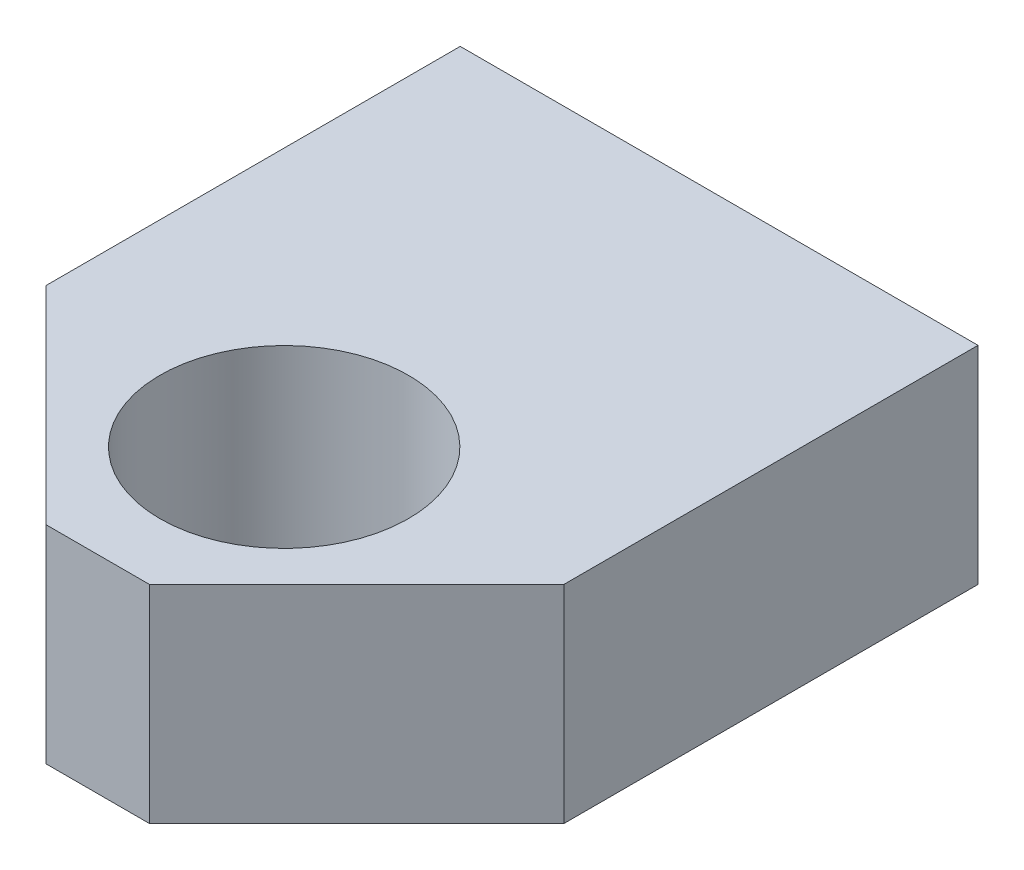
ISO-10303-21;
HEADER;
FILE_DESCRIPTION(('STEP AP214'),'2;1');
FILE_NAME('part.step','',(''),(''),'','','');
FILE_SCHEMA(('AUTOMOTIVE_DESIGN { 1 0 10303 214 1 1 1 1 }'));
ENDSEC;
DATA;
#1=APPLICATION_CONTEXT('core data for automotive mechanical design processes');
#2=APPLICATION_PROTOCOL_DEFINITION('international standard','automotive_design',2000,#1);
#3=PRODUCT_CONTEXT('',#1,'mechanical');
#4=PRODUCT('Part','Part','',(#3));
#5=PRODUCT_RELATED_PRODUCT_CATEGORY('part','',(#4));
#6=PRODUCT_DEFINITION_FORMATION('','',#4);
#7=PRODUCT_DEFINITION_CONTEXT('part definition',#1,'design');
#8=PRODUCT_DEFINITION('design','',#6,#7);
#9=PRODUCT_DEFINITION_SHAPE('','',#8);
#10=(LENGTH_UNIT() NAMED_UNIT(*) SI_UNIT(.MILLI.,.METRE.));
#11=(NAMED_UNIT(*) PLANE_ANGLE_UNIT() SI_UNIT($,.RADIAN.));
#12=(NAMED_UNIT(*) SI_UNIT($,.STERADIAN.) SOLID_ANGLE_UNIT());
#13=UNCERTAINTY_MEASURE_WITH_UNIT(LENGTH_MEASURE(1.E-05),#10,'distance_accuracy_value','');
#14=(GEOMETRIC_REPRESENTATION_CONTEXT(3) GLOBAL_UNCERTAINTY_ASSIGNED_CONTEXT((#13)) GLOBAL_UNIT_ASSIGNED_CONTEXT((#10,
#11,#12)) REPRESENTATION_CONTEXT('',''));
#15=CARTESIAN_POINT('',(0.,0.,0.));
#16=DIRECTION('',(0.,0.,1.));
#17=DIRECTION('',(1.,0.,0.));
#18=AXIS2_PLACEMENT_3D('',#15,#16,#17);
#19=CARTESIAN_POINT('',(-12.5,0.,30.));
#20=DIRECTION('',(1.,0.,0.));
#21=DIRECTION('',(0.,0.,-1.));
#22=AXIS2_PLACEMENT_3D('',#19,#20,#21);
#23=PLANE('',#22);
#24=DIRECTION('',(0.,0.,-1.));
#25=VECTOR('',#24,1.);
#26=CARTESIAN_POINT('',(-12.5,-10.,30.));
#27=LINE('',#26,#25);
#28=CARTESIAN_POINT('',(-12.5,-10.,20.));
#29=VERTEX_POINT('',#28);
#30=CARTESIAN_POINT('',(-12.5,-10.,0.));
#31=VERTEX_POINT('',#30);
#32=EDGE_CURVE('E85',#29,#31,#27,.T.);
#33=ORIENTED_EDGE('',*,*,#32,.F.);
#34=DIRECTION('',(0.,1.,0.));
#35=VECTOR('',#34,1.);
#36=CARTESIAN_POINT('',(-12.5,0.,20.));
#37=LINE('',#36,#35);
#38=CARTESIAN_POINT('',(-12.5,0.,20.));
#39=VERTEX_POINT('',#38);
#40=EDGE_CURVE('E56',#29,#39,#37,.T.);
#41=ORIENTED_EDGE('',*,*,#40,.T.);
#42=DIRECTION('',(0.,0.,-1.));
#43=VECTOR('',#42,1.);
#44=CARTESIAN_POINT('',(-12.5,0.,30.));
#45=LINE('',#44,#43);
#46=CARTESIAN_POINT('',(-12.5,0.,0.));
#47=VERTEX_POINT('',#46);
#48=EDGE_CURVE('E105',#39,#47,#45,.T.);
#49=ORIENTED_EDGE('',*,*,#48,.T.);
#50=DIRECTION('',(0.,-1.,0.));
#51=VECTOR('',#50,1.);
#52=CARTESIAN_POINT('',(-12.5,0.,0.));
#53=LINE('',#52,#51);
#54=EDGE_CURVE('E101',#47,#31,#53,.T.);
#55=ORIENTED_EDGE('',*,*,#54,.T.);
#56=EDGE_LOOP('',(#33,#41,#49,#55));
#57=FACE_BOUND('',#56,.T.);
#58=ADVANCED_FACE('F33',(#57),#23,.F.);
#59=CARTESIAN_POINT('',(-12.5,-10.,30.));
#60=DIRECTION('',(0.,1.,0.));
#61=DIRECTION('',(0.,0.,1.));
#62=AXIS2_PLACEMENT_3D('',#59,#60,#61);
#63=PLANE('',#62);
#64=CARTESIAN_POINT('',(0.,-10.,21.));
#65=DIRECTION('',(0.,1.,0.));
#66=DIRECTION('',(0.,0.,1.));
#67=AXIS2_PLACEMENT_3D('',#64,#65,#66);
#68=CIRCLE('',#67,6.);
#69=CARTESIAN_POINT('',(0.,-10.,27.));
#70=VERTEX_POINT('',#69);
#71=EDGE_CURVE('E107',#70,#70,#68,.T.);
#72=ORIENTED_EDGE('',*,*,#71,.T.);
#73=EDGE_LOOP('',(#72));
#74=FACE_BOUND('',#73,.T.);
#75=DIRECTION('',(1.,0.,0.));
#76=VECTOR('',#75,1.);
#77=CARTESIAN_POINT('',(-12.5,-10.,30.));
#78=LINE('',#77,#76);
#79=CARTESIAN_POINT('',(-2.5,-10.,30.));
#80=VERTEX_POINT('',#79);
#81=CARTESIAN_POINT('',(2.49999999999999,-10.,30.));
#82=VERTEX_POINT('',#81);
#83=EDGE_CURVE('E119',#80,#82,#78,.T.);
#84=ORIENTED_EDGE('',*,*,#83,.F.);
#85=DIRECTION('',(-0.707106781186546,0.,-0.707106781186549));
#86=VECTOR('',#85,1.);
#87=CARTESIAN_POINT('',(-2.5,-10.,30.));
#88=LINE('',#87,#86);
#89=EDGE_CURVE('E92',#80,#29,#88,.T.);
#90=ORIENTED_EDGE('',*,*,#89,.T.);
#91=ORIENTED_EDGE('',*,*,#32,.T.);
#92=DIRECTION('',(1.,0.,0.));
#93=VECTOR('',#92,1.);
#94=CARTESIAN_POINT('',(-12.5,-10.,0.));
#95=LINE('',#94,#93);
#96=CARTESIAN_POINT('',(12.5,-10.,0.));
#97=VERTEX_POINT('',#96);
#98=EDGE_CURVE('E90',#31,#97,#95,.T.);
#99=ORIENTED_EDGE('',*,*,#98,.T.);
#100=DIRECTION('',(0.,0.,-1.));
#101=VECTOR('',#100,1.);
#102=CARTESIAN_POINT('',(12.5,-10.,30.));
#103=LINE('',#102,#101);
#104=CARTESIAN_POINT('',(12.5,-10.,20.));
#105=VERTEX_POINT('',#104);
#106=EDGE_CURVE('E95',#105,#97,#103,.T.);
#107=ORIENTED_EDGE('',*,*,#106,.F.);
#108=DIRECTION('',(-0.707106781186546,0.,0.707106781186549));
#109=VECTOR('',#108,1.);
#110=CARTESIAN_POINT('',(2.5,-10.,30.));
#111=LINE('',#110,#109);
#112=EDGE_CURVE('E129',#105,#82,#111,.T.);
#113=ORIENTED_EDGE('',*,*,#112,.T.);
#114=EDGE_LOOP('',(#84,#90,#91,#99,#107,#113));
#115=FACE_BOUND('',#114,.T.);
#116=ADVANCED_FACE('F88',(#74,#115),#63,.F.);
#117=CARTESIAN_POINT('',(12.5,0.,30.));
#118=DIRECTION('',(-1.,0.,0.));
#119=DIRECTION('',(0.,0.,1.));
#120=AXIS2_PLACEMENT_3D('',#117,#118,#119);
#121=PLANE('',#120);
#122=DIRECTION('',(0.,0.,-1.));
#123=VECTOR('',#122,1.);
#124=CARTESIAN_POINT('',(12.5,0.,30.));
#125=LINE('',#124,#123);
#126=CARTESIAN_POINT('',(12.5,0.,20.));
#127=VERTEX_POINT('',#126);
#128=CARTESIAN_POINT('',(12.5,0.,0.));
#129=VERTEX_POINT('',#128);
#130=EDGE_CURVE('E121',#127,#129,#125,.T.);
#131=ORIENTED_EDGE('',*,*,#130,.F.);
#132=DIRECTION('',(0.,-1.,0.));
#133=VECTOR('',#132,1.);
#134=CARTESIAN_POINT('',(12.5,-10.,20.));
#135=LINE('',#134,#133);
#136=EDGE_CURVE('E11',#127,#105,#135,.T.);
#137=ORIENTED_EDGE('',*,*,#136,.T.);
#138=ORIENTED_EDGE('',*,*,#106,.T.);
#139=DIRECTION('',(0.,1.,0.));
#140=VECTOR('',#139,1.);
#141=CARTESIAN_POINT('',(12.5,0.,0.));
#142=LINE('',#141,#140);
#143=EDGE_CURVE('E103',#97,#129,#142,.T.);
#144=ORIENTED_EDGE('',*,*,#143,.T.);
#145=EDGE_LOOP('',(#131,#137,#138,#144));
#146=FACE_BOUND('',#145,.T.);
#147=ADVANCED_FACE('F156',(#146),#121,.F.);
#148=CARTESIAN_POINT('',(-12.5,0.,30.));
#149=DIRECTION('',(0.,-1.,0.));
#150=DIRECTION('',(0.,0.,-1.));
#151=AXIS2_PLACEMENT_3D('',#148,#149,#150);
#152=PLANE('',#151);
#153=CARTESIAN_POINT('',(0.,0.,21.));
#154=DIRECTION('',(0.,1.,0.));
#155=DIRECTION('',(0.,0.,1.));
#156=AXIS2_PLACEMENT_3D('',#153,#154,#155);
#157=CIRCLE('',#156,6.);
#158=CARTESIAN_POINT('',(0.,0.,27.));
#159=VERTEX_POINT('',#158);
#160=EDGE_CURVE('E110',#159,#159,#157,.T.);
#161=ORIENTED_EDGE('',*,*,#160,.F.);
#162=EDGE_LOOP('',(#161));
#163=FACE_BOUND('',#162,.T.);
#164=ORIENTED_EDGE('',*,*,#48,.F.);
#165=DIRECTION('',(0.707106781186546,0.,0.707106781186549));
#166=VECTOR('',#165,1.);
#167=CARTESIAN_POINT('',(-2.5,0.,30.));
#168=LINE('',#167,#166);
#169=CARTESIAN_POINT('',(-2.5,0.,30.));
#170=VERTEX_POINT('',#169);
#171=EDGE_CURVE('E41',#39,#170,#168,.T.);
#172=ORIENTED_EDGE('',*,*,#171,.T.);
#173=DIRECTION('',(-1.,0.,0.));
#174=VECTOR('',#173,1.);
#175=CARTESIAN_POINT('',(-12.5,0.,30.));
#176=LINE('',#175,#174);
#177=CARTESIAN_POINT('',(2.49999999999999,0.,30.));
#178=VERTEX_POINT('',#177);
#179=EDGE_CURVE('E113',#178,#170,#176,.T.);
#180=ORIENTED_EDGE('',*,*,#179,.F.);
#181=DIRECTION('',(0.707106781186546,0.,-0.707106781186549));
#182=VECTOR('',#181,1.);
#183=CARTESIAN_POINT('',(2.5,0.,30.));
#184=LINE('',#183,#182);
#185=EDGE_CURVE('E48',#178,#127,#184,.T.);
#186=ORIENTED_EDGE('',*,*,#185,.T.);
#187=ORIENTED_EDGE('',*,*,#130,.T.);
#188=DIRECTION('',(-1.,0.,0.));
#189=VECTOR('',#188,1.);
#190=CARTESIAN_POINT('',(-12.5,0.,0.));
#191=LINE('',#190,#189);
#192=EDGE_CURVE('E117',#129,#47,#191,.T.);
#193=ORIENTED_EDGE('',*,*,#192,.T.);
#194=EDGE_LOOP('',(#164,#172,#180,#186,#187,#193));
#195=FACE_BOUND('',#194,.T.);
#196=ADVANCED_FACE('F135',(#163,#195),#152,.F.);
#197=CARTESIAN_POINT('',(0.,0.,30.));
#198=DIRECTION('',(0.,0.,1.));
#199=DIRECTION('',(1.,0.,0.));
#200=AXIS2_PLACEMENT_3D('',#197,#198,#199);
#201=PLANE('',#200);
#202=ORIENTED_EDGE('',*,*,#179,.T.);
#203=DIRECTION('',(0.,-1.,0.));
#204=VECTOR('',#203,1.);
#205=CARTESIAN_POINT('',(-2.5,-10.,30.));
#206=LINE('',#205,#204);
#207=EDGE_CURVE('E126',#170,#80,#206,.T.);
#208=ORIENTED_EDGE('',*,*,#207,.T.);
#209=ORIENTED_EDGE('',*,*,#83,.T.);
#210=DIRECTION('',(0.,1.,0.));
#211=VECTOR('',#210,1.);
#212=CARTESIAN_POINT('',(2.5,0.,30.));
#213=LINE('',#212,#211);
#214=EDGE_CURVE('E94',#82,#178,#213,.T.);
#215=ORIENTED_EDGE('',*,*,#214,.T.);
#216=EDGE_LOOP('',(#202,#208,#209,#215));
#217=FACE_BOUND('',#216,.T.);
#218=ADVANCED_FACE('F139',(#217),#201,.T.);
#219=CARTESIAN_POINT('',(0.,0.,0.));
#220=DIRECTION('',(0.,0.,1.));
#221=DIRECTION('',(1.,0.,0.));
#222=AXIS2_PLACEMENT_3D('',#219,#220,#221);
#223=PLANE('',#222);
#224=ORIENTED_EDGE('',*,*,#54,.F.);
#225=ORIENTED_EDGE('',*,*,#192,.F.);
#226=ORIENTED_EDGE('',*,*,#143,.F.);
#227=ORIENTED_EDGE('',*,*,#98,.F.);
#228=EDGE_LOOP('',(#224,#225,#226,#227));
#229=FACE_BOUND('',#228,.T.);
#230=ADVANCED_FACE('F99',(#229),#223,.F.);
#231=CARTESIAN_POINT('',(-2.5,0.,30.));
#232=DIRECTION('',(-0.707106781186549,0.,0.707106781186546));
#233=DIRECTION('',(0.,1.,0.));
#234=AXIS2_PLACEMENT_3D('',#231,#232,#233);
#235=PLANE('',#234);
#236=ORIENTED_EDGE('',*,*,#171,.F.);
#237=ORIENTED_EDGE('',*,*,#40,.F.);
#238=ORIENTED_EDGE('',*,*,#89,.F.);
#239=ORIENTED_EDGE('',*,*,#207,.F.);
#240=EDGE_LOOP('',(#236,#237,#238,#239));
#241=FACE_BOUND('',#240,.T.);
#242=ADVANCED_FACE('F142',(#241),#235,.T.);
#243=CARTESIAN_POINT('',(2.5,0.,30.));
#244=DIRECTION('',(0.707106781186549,0.,0.707106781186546));
#245=DIRECTION('',(0.,-1.,0.));
#246=AXIS2_PLACEMENT_3D('',#243,#244,#245);
#247=PLANE('',#246);
#248=ORIENTED_EDGE('',*,*,#112,.F.);
#249=ORIENTED_EDGE('',*,*,#136,.F.);
#250=ORIENTED_EDGE('',*,*,#185,.F.);
#251=ORIENTED_EDGE('',*,*,#214,.F.);
#252=EDGE_LOOP('',(#248,#249,#250,#251));
#253=FACE_BOUND('',#252,.T.);
#254=ADVANCED_FACE('F35',(#253),#247,.T.);
#255=CARTESIAN_POINT('',(0.,-10.,21.));
#256=DIRECTION('',(0.,1.,0.));
#257=DIRECTION('',(0.,0.,1.));
#258=AXIS2_PLACEMENT_3D('',#255,#256,#257);
#259=CYLINDRICAL_SURFACE('',#258,6.);
#260=ORIENTED_EDGE('',*,*,#71,.F.);
#261=EDGE_LOOP('',(#260));
#262=FACE_BOUND('',#261,.T.);
#263=ORIENTED_EDGE('',*,*,#160,.T.);
#264=EDGE_LOOP('',(#263));
#265=FACE_BOUND('',#264,.T.);
#266=ADVANCED_FACE('F148',(#262,#265),#259,.F.);
#267=CLOSED_SHELL('',(#58,#116,#147,#196,#218,#230,#242,#254,#266));
#268=MANIFOLD_SOLID_BREP('B2',#267);
#269=ADVANCED_BREP_SHAPE_REPRESENTATION('',(#18,#268),#14);
#270=SHAPE_DEFINITION_REPRESENTATION(#9,#269);
ENDSEC;
END-ISO-10303-21;
